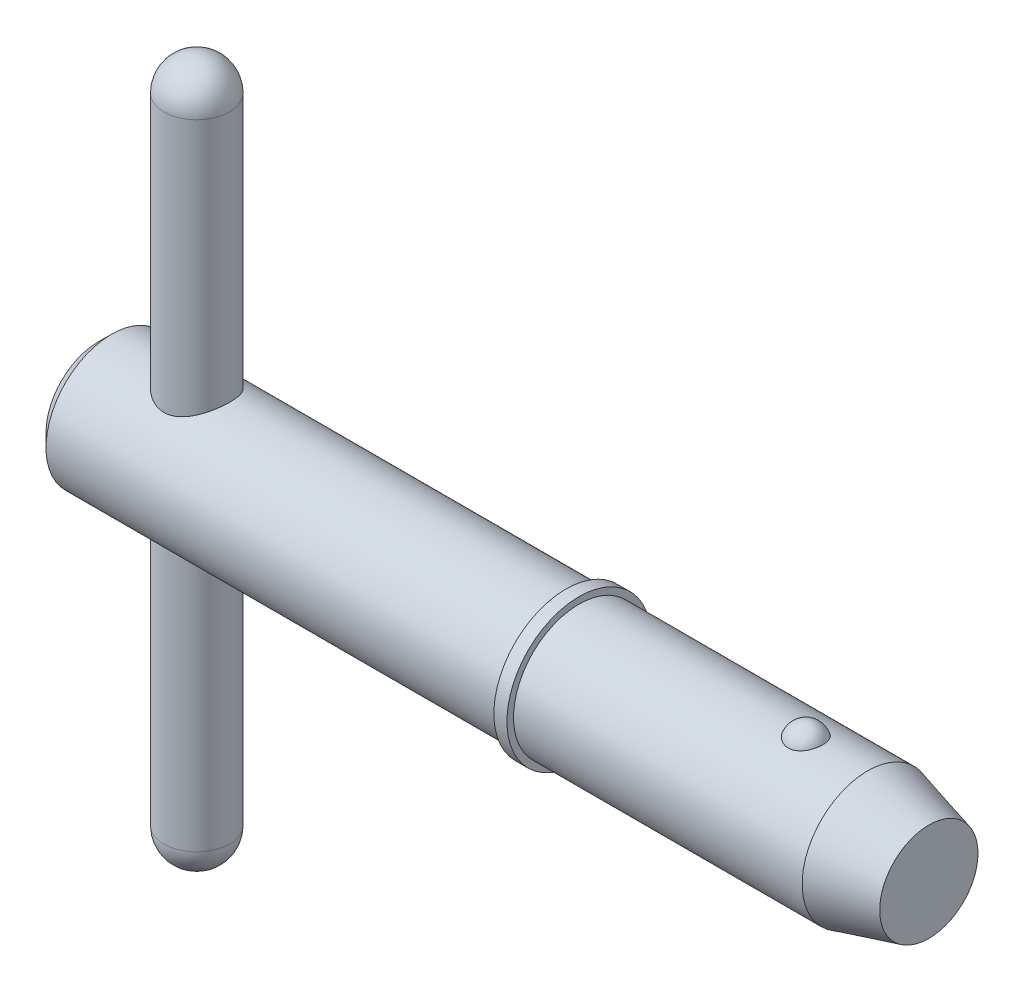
ISO-10303-21;
HEADER;
FILE_DESCRIPTION(('STEP AP214'),'2;1');
FILE_NAME('part.step','',(''),(''),'','','');
FILE_SCHEMA(('AUTOMOTIVE_DESIGN { 1 0 10303 214 1 1 1 1 }'));
ENDSEC;
DATA;
#1=APPLICATION_CONTEXT('core data for automotive mechanical design processes');
#2=APPLICATION_PROTOCOL_DEFINITION('international standard','automotive_design',2000,#1);
#3=PRODUCT_CONTEXT('',#1,'mechanical');
#4=PRODUCT('Part','Part','',(#3));
#5=PRODUCT_RELATED_PRODUCT_CATEGORY('part','',(#4));
#6=PRODUCT_DEFINITION_FORMATION('','',#4);
#7=PRODUCT_DEFINITION_CONTEXT('part definition',#1,'design');
#8=PRODUCT_DEFINITION('design','',#6,#7);
#9=PRODUCT_DEFINITION_SHAPE('','',#8);
#10=(LENGTH_UNIT() NAMED_UNIT(*) SI_UNIT(.MILLI.,.METRE.));
#11=(NAMED_UNIT(*) PLANE_ANGLE_UNIT() SI_UNIT($,.RADIAN.));
#12=(NAMED_UNIT(*) SI_UNIT($,.STERADIAN.) SOLID_ANGLE_UNIT());
#13=UNCERTAINTY_MEASURE_WITH_UNIT(LENGTH_MEASURE(1.E-05),#10,'distance_accuracy_value','');
#14=(GEOMETRIC_REPRESENTATION_CONTEXT(3) GLOBAL_UNCERTAINTY_ASSIGNED_CONTEXT((#13)) GLOBAL_UNIT_ASSIGNED_CONTEXT((#10,
#11,#12)) REPRESENTATION_CONTEXT('',''));
#15=CARTESIAN_POINT('',(0.,0.,0.));
#16=DIRECTION('',(0.,0.,1.));
#17=DIRECTION('',(1.,0.,0.));
#18=AXIS2_PLACEMENT_3D('',#15,#16,#17);
#19=CARTESIAN_POINT('',(3.57,12.7,0.));
#20=DIRECTION('',(0.,-1.,0.));
#21=DIRECTION('',(0.,0.,-1.));
#22=AXIS2_PLACEMENT_3D('',#19,#20,#21);
#23=CYLINDRICAL_SURFACE('',#22,1.19);
#24=CARTESIAN_POINT('',(3.57,-11.51,0.));
#25=DIRECTION('',(0.,-1.,0.));
#26=DIRECTION('',(0.,0.,-1.));
#27=AXIS2_PLACEMENT_3D('',#24,#25,#26);
#28=CIRCLE('',#27,1.19);
#29=CARTESIAN_POINT('',(3.57,-11.51,-1.19));
#30=VERTEX_POINT('',#29);
#31=EDGE_CURVE('P0_E10',#30,#30,#28,.F.);
#32=ORIENTED_EDGE('',*,*,#31,.T.);
#33=EDGE_LOOP('',(#32));
#34=FACE_BOUND('',#33,.T.);
#35=CARTESIAN_POINT('',(3.57,11.51,0.));
#36=DIRECTION('',(0.,-1.,0.));
#37=DIRECTION('',(0.,0.,-1.));
#38=AXIS2_PLACEMENT_3D('',#35,#36,#37);
#39=CIRCLE('',#38,1.19);
#40=CARTESIAN_POINT('',(3.57,11.51,-1.19));
#41=VERTEX_POINT('',#40);
#42=EDGE_CURVE('P0_E21',#41,#41,#39,.T.);
#43=ORIENTED_EDGE('',*,*,#42,.T.);
#44=EDGE_LOOP('',(#43));
#45=FACE_BOUND('',#44,.T.);
#46=ADVANCED_FACE('P0_F14',(#34,#45),#23,.T.);
#47=CARTESIAN_POINT('',(3.57,-11.51,0.));
#48=DIRECTION('',(0.,0.,1.));
#49=DIRECTION('',(1.,0.,0.));
#50=AXIS2_PLACEMENT_3D('',#47,#48,#49);
#51=SPHERICAL_SURFACE('',#50,1.19);
#52=CARTESIAN_POINT('',(3.57,-11.51,0.));
#53=DIRECTION('',(0.,-1.,0.));
#54=DIRECTION('',(0.,0.,-1.));
#55=AXIS2_PLACEMENT_3D('',#52,#53,#54);
#56=SPHERICAL_SURFACE('',#55,1.19);
#57=ORIENTED_EDGE('',*,*,#31,.F.);
#58=EDGE_LOOP('',(#57));
#59=FACE_BOUND('',#58,.T.);
#60=ADVANCED_FACE('P0_F29',(#59),#56,.T.);
#61=CARTESIAN_POINT('',(3.57,11.51,0.));
#62=DIRECTION('',(0.,0.,1.));
#63=DIRECTION('',(1.,0.,0.));
#64=AXIS2_PLACEMENT_3D('',#61,#62,#63);
#65=SPHERICAL_SURFACE('',#64,1.19);
#66=CARTESIAN_POINT('',(3.57,11.51,0.));
#67=DIRECTION('',(0.,-1.,0.));
#68=DIRECTION('',(0.,0.,-1.));
#69=AXIS2_PLACEMENT_3D('',#66,#67,#68);
#70=SPHERICAL_SURFACE('',#69,1.19);
#71=ORIENTED_EDGE('',*,*,#42,.F.);
#72=EDGE_LOOP('',(#71));
#73=FACE_BOUND('',#72,.T.);
#74=ADVANCED_FACE('P0_F16',(#73),#70,.T.);
#75=CLOSED_SHELL('',(#46,#60,#74));
#76=MANIFOLD_SOLID_BREP('P0_B1',#75);
#77=CARTESIAN_POINT('',(0.,0.,0.));
#78=DIRECTION('',(1.,0.,0.));
#79=DIRECTION('',(0.,0.,-1.));
#80=AXIS2_PLACEMENT_3D('',#77,#78,#79);
#81=CYLINDRICAL_SURFACE('',#80,2.38);
#82=CARTESIAN_POINT('',(27.9294297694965,0.,0.));
#83=DIRECTION('',(1.,0.,0.));
#84=DIRECTION('',(0.,0.,-1.));
#85=AXIS2_PLACEMENT_3D('',#82,#83,#84);
#86=CIRCLE('',#85,2.38);
#87=CARTESIAN_POINT('',(27.9294297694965,0.,-2.38));
#88=VERTEX_POINT('',#87);
#89=EDGE_CURVE('P1_E81',#88,#88,#86,.T.);
#90=ORIENTED_EDGE('',*,*,#89,.F.);
#91=EDGE_LOOP('',(#90));
#92=FACE_BOUND('',#91,.T.);
#93=CARTESIAN_POINT('',(17.45,0.,0.));
#94=DIRECTION('',(1.,0.,0.));
#95=DIRECTION('',(0.,0.,-1.));
#96=AXIS2_PLACEMENT_3D('',#93,#94,#95);
#97=CIRCLE('',#96,2.38);
#98=CARTESIAN_POINT('',(17.45,0.,-2.38));
#99=VERTEX_POINT('',#98);
#100=EDGE_CURVE('P1_E85',#99,#99,#97,.T.);
#101=ORIENTED_EDGE('',*,*,#100,.T.);
#102=EDGE_LOOP('',(#101));
#103=FACE_BOUND('',#102,.T.);
#104=CARTESIAN_POINT('',(25.6834492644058,2.2921568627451,0.640637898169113));
#105=CARTESIAN_POINT('',(25.6503559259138,2.29215737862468,0.64063719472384));
#106=CARTESIAN_POINT('',(25.6172546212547,2.29293179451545,0.637884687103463));
#107=CARTESIAN_POINT('',(25.5520176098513,2.29594030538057,0.626968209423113));
#108=CARTESIAN_POINT('',(25.5198823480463,2.29817506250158,0.618801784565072));
#109=CARTESIAN_POINT('',(25.4575402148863,2.3038430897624,0.597351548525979));
#110=CARTESIAN_POINT('',(25.4273305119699,2.30727454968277,0.584075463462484));
#111=CARTESIAN_POINT('',(25.3695674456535,2.31495941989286,0.552829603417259));
#112=CARTESIAN_POINT('',(25.3420141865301,2.31921286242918,0.53485964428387));
#113=CARTESIAN_POINT('',(25.2895938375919,2.32820213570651,0.494282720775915));
#114=CARTESIAN_POINT('',(25.2648050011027,2.33294694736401,0.471576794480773));
#115=CARTESIAN_POINT('',(25.2192169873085,2.34234144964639,0.422446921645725));
#116=CARTESIAN_POINT('',(25.1984185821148,2.34699112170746,0.396022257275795));
#117=CARTESIAN_POINT('',(25.1603580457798,2.35593942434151,0.338855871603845));
#118=CARTESIAN_POINT('',(25.1433051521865,2.36021170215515,0.307970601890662));
#119=CARTESIAN_POINT('',(25.1143607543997,2.3677057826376,0.243750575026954));
#120=CARTESIAN_POINT('',(25.1024701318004,2.37092740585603,0.210415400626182));
#121=CARTESIAN_POINT('',(25.0838076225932,2.37606901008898,0.141189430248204));
#122=CARTESIAN_POINT('',(25.0771956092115,2.37794816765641,0.105252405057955));
#123=CARTESIAN_POINT('',(25.0698095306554,2.38005135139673,0.0327351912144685));
#124=CARTESIAN_POINT('',(25.0690358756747,2.38027526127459,-0.00384504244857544));
#125=CARTESIAN_POINT('',(25.0733628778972,2.37903842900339,-0.0769838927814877));
#126=CARTESIAN_POINT('',(25.0785202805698,2.37756141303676,-0.113538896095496));
#127=CARTESIAN_POINT('',(25.0947013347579,2.37305303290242,-0.185229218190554));
#128=CARTESIAN_POINT('',(25.1057251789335,2.37002161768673,-0.220364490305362));
#129=CARTESIAN_POINT('',(25.1333977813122,2.36273722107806,-0.288156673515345));
#130=CARTESIAN_POINT('',(25.1500389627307,2.35848588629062,-0.320816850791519));
#131=CARTESIAN_POINT('',(25.1885984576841,2.34923130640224,-0.382744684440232));
#132=CARTESIAN_POINT('',(25.210516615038,2.34422808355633,-0.412012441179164));
#133=CARTESIAN_POINT('',(25.2587549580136,2.33412555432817,-0.465830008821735));
#134=CARTESIAN_POINT('',(25.2850028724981,2.32902887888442,-0.490444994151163));
#135=CARTESIAN_POINT('',(25.3414769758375,2.31926941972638,-0.534700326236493));
#136=CARTESIAN_POINT('',(25.371702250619,2.3146065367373,-0.554341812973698));
#137=CARTESIAN_POINT('',(25.4340618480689,2.30645675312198,-0.58731242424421));
#138=CARTESIAN_POINT('',(25.4660780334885,2.30293152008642,-0.60085527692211));
#139=CARTESIAN_POINT('',(25.5320795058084,2.29725171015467,-0.622220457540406));
#140=CARTESIAN_POINT('',(25.5660641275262,2.29509667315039,-0.630044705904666));
#141=CARTESIAN_POINT('',(25.633299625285,2.29249264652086,-0.639452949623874));
#142=CARTESIAN_POINT('',(25.6665087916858,2.29196755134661,-0.641315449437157));
#143=CARTESIAN_POINT('',(25.732763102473,2.29246849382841,-0.639522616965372));
#144=CARTESIAN_POINT('',(25.7658082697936,2.29349430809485,-0.635868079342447));
#145=CARTESIAN_POINT('',(25.8301025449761,2.29694059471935,-0.623301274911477));
#146=CARTESIAN_POINT('',(25.8613744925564,2.29933234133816,-0.614497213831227));
#147=CARTESIAN_POINT('',(25.9219952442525,2.30522511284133,-0.592006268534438));
#148=CARTESIAN_POINT('',(25.9513438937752,2.30872622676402,-0.57831899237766));
#149=CARTESIAN_POINT('',(26.0080369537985,2.31655795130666,-0.546112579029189));
#150=CARTESIAN_POINT('',(26.035320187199,2.32090569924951,-0.527490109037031));
#151=CARTESIAN_POINT('',(26.0864904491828,2.32992206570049,-0.486117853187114));
#152=CARTESIAN_POINT('',(26.1103767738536,2.33459075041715,-0.463367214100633));
#153=CARTESIAN_POINT('',(26.1552722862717,2.34399834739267,-0.413220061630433));
#154=CARTESIAN_POINT('',(26.1760972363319,2.34873051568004,-0.385657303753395));
#155=CARTESIAN_POINT('',(26.213056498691,2.35754932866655,-0.327455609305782));
#156=CARTESIAN_POINT('',(26.2291898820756,2.36163584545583,-0.2968160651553));
#157=CARTESIAN_POINT('',(26.2569822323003,2.36889321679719,-0.232047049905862));
#158=CARTESIAN_POINT('',(26.2684450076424,2.37202275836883,-0.197828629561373));
#159=CARTESIAN_POINT('',(26.2857523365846,2.37681926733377,-0.127900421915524));
#160=CARTESIAN_POINT('',(26.2915962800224,2.37848607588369,-0.092190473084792));
#161=CARTESIAN_POINT('',(26.297605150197,2.38020024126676,-0.0196348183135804));
#162=CARTESIAN_POINT('',(26.2976704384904,2.38021918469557,0.0172198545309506));
#163=CARTESIAN_POINT('',(26.2918689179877,2.37856356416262,0.0904219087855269));
#164=CARTESIAN_POINT('',(26.2860018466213,2.37688892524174,0.12676926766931));
#165=CARTESIAN_POINT('',(26.268425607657,2.37201688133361,0.198028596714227));
#166=CARTESIAN_POINT('',(26.2566998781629,2.36881516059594,0.232936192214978));
#167=CARTESIAN_POINT('',(26.2276354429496,2.36123444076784,0.300196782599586));
#168=CARTESIAN_POINT('',(26.2102967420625,2.3568554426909,0.33254977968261));
#169=CARTESIAN_POINT('',(26.1705350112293,2.34744667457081,0.393495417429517));
#170=CARTESIAN_POINT('',(26.1481528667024,2.34242227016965,0.422115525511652));
#171=CARTESIAN_POINT('',(26.0987391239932,2.33227293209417,0.475004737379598));
#172=CARTESIAN_POINT('',(26.0717076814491,2.32714800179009,0.499273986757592));
#173=CARTESIAN_POINT('',(26.0144988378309,2.31755359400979,0.542046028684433));
#174=CARTESIAN_POINT('',(25.9844297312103,2.3130698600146,0.560690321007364));
#175=CARTESIAN_POINT('',(25.9213869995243,2.30514125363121,0.592447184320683));
#176=CARTESIAN_POINT('',(25.8884158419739,2.30169550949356,0.605564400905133));
#177=CARTESIAN_POINT('',(25.8268424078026,2.29677744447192,0.623927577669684));
#178=CARTESIAN_POINT('',(25.7985555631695,2.295058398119,0.630178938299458));
#179=CARTESIAN_POINT('',(25.7413308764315,2.29274795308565,0.638534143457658));
#180=CARTESIAN_POINT('',(25.7123931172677,2.29215641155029,0.640638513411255));
#181=CARTESIAN_POINT('',(25.6834492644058,2.2921568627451,0.640637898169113));
#182=B_SPLINE_CURVE_WITH_KNOTS('',3,(#104,#105,#106,#107,#108,#109,#110,#111,#112,#113,#114,
#115,#116,#117,#118,#119,#120,#121,#122,#123,#124,#125,#126,#127,#128,#129,#130,#131,#132,#133,
#134,#135,#136,#137,#138,#139,#140,#141,#142,#143,#144,#145,#146,#147,#148,#149,#150,#151,#152,
#153,#154,#155,#156,#157,#158,#159,#160,#161,#162,#163,#164,#165,#166,#167,#168,#169,#170,#171,
#172,#173,#174,#175,#176,#177,#178,#179,#180,#181),.UNSPECIFIED.,.T.,.F.,(4,2,2,2,2,2,2,2,2,2,2,
2,2,2,2,2,2,2,2,2,2,2,2,2,2,2,2,2,2,2,2,2,2,2,2,2,2,2,4),(0.,0.0991724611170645,
0.19838992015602,0.297457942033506,0.396529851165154,0.49792776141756,0.59934527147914,
0.705475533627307,0.811623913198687,0.920876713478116,1.03013718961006,1.14045177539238,
1.25076998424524,1.36093998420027,1.47110672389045,1.57959248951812,1.68805336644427,
1.79234266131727,1.89659691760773,1.99590391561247,2.09519661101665,2.19247425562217,
2.28975970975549,2.38926978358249,2.48880044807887,2.59293588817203,2.69709193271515,
2.80525821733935,2.91343624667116,3.02347917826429,3.13352698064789,3.24388765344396,
3.35424823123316,3.46374443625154,3.5732369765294,3.67968690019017,3.78604717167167,
3.87279565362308,3.9595331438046),.UNSPECIFIED.);
#183=CARTESIAN_POINT('',(25.6834492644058,2.2921568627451,0.640637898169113));
#184=VERTEX_POINT('',#183);
#185=EDGE_CURVE('P1_E35',#184,#184,#182,.T.);
#186=ORIENTED_EDGE('',*,*,#185,.T.);
#187=EDGE_LOOP('',(#186));
#188=FACE_BOUND('',#187,.T.);
#189=ADVANCED_FACE('P1_F13',(#92,#103,#188),#81,.T.);
#190=CARTESIAN_POINT('',(0.,0.,0.));
#191=DIRECTION('',(-1.,0.,0.));
#192=DIRECTION('',(0.,0.,1.));
#193=AXIS2_PLACEMENT_3D('',#190,#191,#192);
#194=PLANE('',#193);
#195=CARTESIAN_POINT('',(0.,0.,0.));
#196=DIRECTION('',(1.,0.,0.));
#197=DIRECTION('',(0.,0.,-1.));
#198=AXIS2_PLACEMENT_3D('',#195,#196,#197);
#199=CIRCLE('',#198,1.904);
#200=CARTESIAN_POINT('',(0.,0.,-1.904));
#201=VERTEX_POINT('',#200);
#202=EDGE_CURVE('P1_E9',#201,#201,#199,.T.);
#203=ORIENTED_EDGE('',*,*,#202,.F.);
#204=EDGE_LOOP('',(#203));
#205=FACE_BOUND('',#204,.T.);
#206=ADVANCED_FACE('P1_F15',(#205),#194,.T.);
#207=CARTESIAN_POINT('',(0.475999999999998,0.,0.));
#208=DIRECTION('',(1.,0.,0.));
#209=DIRECTION('',(0.,0.,-1.));
#210=AXIS2_PLACEMENT_3D('',#207,#208,#209);
#211=CONICAL_SURFACE('',#210,2.38,0.78539816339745);
#212=ORIENTED_EDGE('',*,*,#202,.T.);
#213=EDGE_LOOP('',(#212));
#214=FACE_BOUND('',#213,.T.);
#215=CARTESIAN_POINT('',(0.475999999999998,0.,0.));
#216=DIRECTION('',(1.,0.,0.));
#217=DIRECTION('',(0.,0.,-1.));
#218=AXIS2_PLACEMENT_3D('',#215,#216,#217);
#219=CIRCLE('',#218,2.38);
#220=CARTESIAN_POINT('',(0.475999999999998,0.,-2.38));
#221=VERTEX_POINT('',#220);
#222=EDGE_CURVE('P1_E26',#221,#221,#219,.T.);
#223=ORIENTED_EDGE('',*,*,#222,.F.);
#224=EDGE_LOOP('',(#223));
#225=FACE_BOUND('',#224,.T.);
#226=ADVANCED_FACE('P1_F77',(#214,#225),#211,.T.);
#227=CARTESIAN_POINT('',(0.,0.,0.));
#228=DIRECTION('',(1.,0.,0.));
#229=DIRECTION('',(0.,0.,-1.));
#230=AXIS2_PLACEMENT_3D('',#227,#228,#229);
#231=CYLINDRICAL_SURFACE('',#230,2.38);
#232=CARTESIAN_POINT('',(3.57,-2.06114046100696,1.19));
#233=CARTESIAN_POINT('',(3.50799170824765,-2.06114586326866,1.18999567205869));
#234=CARTESIAN_POINT('',(3.4459051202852,-2.0639812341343,1.18512096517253));
#235=CARTESIAN_POINT('',(3.32363755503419,-2.07491216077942,1.16587061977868));
#236=CARTESIAN_POINT('',(3.26346086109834,-2.08301876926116,1.15147501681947));
#237=CARTESIAN_POINT('',(3.14701251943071,-2.10331722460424,1.11395893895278));
#238=CARTESIAN_POINT('',(3.09072196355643,-2.1154873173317,1.09088484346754));
#239=CARTESIAN_POINT('',(2.9828251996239,-2.14250771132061,1.03680835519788));
#240=CARTESIAN_POINT('',(2.93121924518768,-2.15735815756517,1.00580553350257));
#241=CARTESIAN_POINT('',(2.82945618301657,-2.18956274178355,0.933753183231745));
#242=CARTESIAN_POINT('',(2.77976962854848,-2.20702235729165,0.892085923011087));
#243=CARTESIAN_POINT('',(2.68772401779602,-2.2416265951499,0.801172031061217));
#244=CARTESIAN_POINT('',(2.64536861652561,-2.25877105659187,0.751921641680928));
#245=CARTESIAN_POINT('',(2.56639309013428,-2.29219557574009,0.64318258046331));
#246=CARTESIAN_POINT('',(2.53035201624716,-2.30833946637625,0.583227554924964));
#247=CARTESIAN_POINT('',(2.46908238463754,-2.3365739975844,0.45714686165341));
#248=CARTESIAN_POINT('',(2.44384700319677,-2.34866719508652,0.391025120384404));
#249=CARTESIAN_POINT('',(2.40676945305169,-2.36667748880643,0.259473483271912));
#250=CARTESIAN_POINT('',(2.39410206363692,-2.37297281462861,0.194329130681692));
#251=CARTESIAN_POINT('',(2.3798023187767,-2.3800902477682,0.0625590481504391));
#252=CARTESIAN_POINT('',(2.37816328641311,-2.38091566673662,-0.00406576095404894));
#253=CARTESIAN_POINT('',(2.38564854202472,-2.37717948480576,-0.130700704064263));
#254=CARTESIAN_POINT('',(2.39384923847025,-2.37308010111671,-0.190782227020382));
#255=CARTESIAN_POINT('',(2.41912820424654,-2.360653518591,-0.308583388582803));
#256=CARTESIAN_POINT('',(2.43620713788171,-2.35232600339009,-0.366302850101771));
#257=CARTESIAN_POINT('',(2.47886825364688,-2.33206184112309,-0.478748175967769));
#258=CARTESIAN_POINT('',(2.50456481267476,-2.32007685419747,-0.533421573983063));
#259=CARTESIAN_POINT('',(2.56357346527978,-2.29357798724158,-0.637812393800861));
#260=CARTESIAN_POINT('',(2.5968882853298,-2.27906320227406,-0.687528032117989));
#261=CARTESIAN_POINT('',(2.67380546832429,-2.24724829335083,-0.785606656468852));
#262=CARTESIAN_POINT('',(2.71808260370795,-2.22981457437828,-0.833397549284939));
#263=CARTESIAN_POINT('',(2.81386177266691,-2.19500665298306,-0.921184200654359));
#264=CARTESIAN_POINT('',(2.86536931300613,-2.17763250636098,-0.961173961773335));
#265=CARTESIAN_POINT('',(2.97815134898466,-2.14371545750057,-1.03471134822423));
#266=CARTESIAN_POINT('',(3.03983836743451,-2.12729540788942,-1.06768860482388));
#267=CARTESIAN_POINT('',(3.16889582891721,-2.09886785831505,-1.12254974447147));
#268=CARTESIAN_POINT('',(3.2362602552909,-2.0868557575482,-1.14444520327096));
#269=CARTESIAN_POINT('',(3.36914526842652,-2.06994116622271,-1.1747444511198));
#270=CARTESIAN_POINT('',(3.43438893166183,-2.06455070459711,-1.18407989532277));
#271=CARTESIAN_POINT('',(3.56571759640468,-2.06010324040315,-1.1918051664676));
#272=CARTESIAN_POINT('',(3.63180197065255,-2.06104176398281,-1.19020272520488));
#273=CARTESIAN_POINT('',(3.75522816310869,-2.06862860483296,-1.17695289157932));
#274=CARTESIAN_POINT('',(3.81273554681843,-2.07464109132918,-1.16642350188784));
#275=CARTESIAN_POINT('',(3.92505766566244,-2.09075885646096,-1.1372785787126));
#276=CARTESIAN_POINT('',(3.97987152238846,-2.1008654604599,-1.1186604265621));
#277=CARTESIAN_POINT('',(4.08813948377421,-2.12458104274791,-1.07296063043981));
#278=CARTESIAN_POINT('',(4.14141303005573,-2.13833055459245,-1.04552693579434));
#279=CARTESIAN_POINT('',(4.2429084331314,-2.16765782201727,-0.983281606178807));
#280=CARTESIAN_POINT('',(4.29112767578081,-2.18323651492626,-0.948466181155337));
#281=CARTESIAN_POINT('',(4.38750473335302,-2.2168271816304,-0.867316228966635));
#282=CARTESIAN_POINT('',(4.43488860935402,-2.23489833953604,-0.82008287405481));
#283=CARTESIAN_POINT('',(4.52130056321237,-2.26973739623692,-0.718051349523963));
#284=CARTESIAN_POINT('',(4.56032581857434,-2.28650485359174,-0.663250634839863));
#285=CARTESIAN_POINT('',(4.62978273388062,-2.31742220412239,-0.545657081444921));
#286=CARTESIAN_POINT('',(4.65996041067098,-2.33149133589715,-0.482691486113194));
#287=CARTESIAN_POINT('',(4.7089941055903,-2.35481192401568,-0.351671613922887));
#288=CARTESIAN_POINT('',(4.7278600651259,-2.36406760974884,-0.283621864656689));
#289=CARTESIAN_POINT('',(4.75210859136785,-2.3760433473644,-0.151105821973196));
#290=CARTESIAN_POINT('',(4.75856947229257,-2.37928514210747,-0.0868836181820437));
#291=CARTESIAN_POINT('',(4.76100348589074,-2.38050135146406,0.0417999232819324));
#292=CARTESIAN_POINT('',(4.75698028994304,-2.37847760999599,0.106261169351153));
#293=CARTESIAN_POINT('',(4.73927447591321,-2.36969422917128,0.229120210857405));
#294=CARTESIAN_POINT('',(4.72624582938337,-2.36325544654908,0.287637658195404));
#295=CARTESIAN_POINT('',(4.69178087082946,-2.34658591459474,0.401560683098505));
#296=CARTESIAN_POINT('',(4.67034335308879,-2.33635462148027,0.456965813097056));
#297=CARTESIAN_POINT('',(4.61871480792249,-2.31247857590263,0.565753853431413));
#298=CARTESIAN_POINT('',(4.58818860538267,-2.29870654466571,0.618948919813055));
#299=CARTESIAN_POINT('',(4.51967006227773,-2.26918878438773,0.719681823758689));
#300=CARTESIAN_POINT('',(4.48167429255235,-2.25344215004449,0.76721704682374));
#301=CARTESIAN_POINT('',(4.39491140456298,-2.21969046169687,0.860267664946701));
#302=CARTESIAN_POINT('',(4.34544863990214,-2.20161660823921,0.905111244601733));
#303=CARTESIAN_POINT('',(4.23943364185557,-2.16655060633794,0.986109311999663));
#304=CARTESIAN_POINT('',(4.18287520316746,-2.1495594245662,1.02225611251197));
#305=CARTESIAN_POINT('',(4.06190239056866,-2.1181953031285,1.08579298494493));
#306=CARTESIAN_POINT('',(3.9972962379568,-2.10392207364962,1.11287022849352));
#307=CARTESIAN_POINT('',(3.86353443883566,-2.08090726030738,1.15534566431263));
#308=CARTESIAN_POINT('',(3.7943948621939,-2.07214719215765,1.17078291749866));
#309=CARTESIAN_POINT('',(3.69875162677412,-2.06499834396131,1.18329673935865));
#310=CARTESIAN_POINT('',(3.67309220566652,-2.06355673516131,1.18580656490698));
#311=CARTESIAN_POINT('',(3.62162638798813,-2.06162663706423,1.18915915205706));
#312=CARTESIAN_POINT('',(3.59581998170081,-2.0611382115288,1.19000180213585));
#313=CARTESIAN_POINT('',(3.57,-2.06114046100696,1.19));
#314=B_SPLINE_CURVE_WITH_KNOTS('',3,(#232,#233,#234,#235,#236,#237,#238,#239,#240,#241,#242,
#243,#244,#245,#246,#247,#248,#249,#250,#251,#252,#253,#254,#255,#256,#257,#258,#259,#260,#261,
#262,#263,#264,#265,#266,#267,#268,#269,#270,#271,#272,#273,#274,#275,#276,#277,#278,#279,#280,
#281,#282,#283,#284,#285,#286,#287,#288,#289,#290,#291,#292,#293,#294,#295,#296,#297,#298,#299,
#300,#301,#302,#303,#304,#305,#306,#307,#308,#309,#310,#311,#312,#313),.UNSPECIFIED.,.T.,.F.,(4,
2,2,2,2,2,2,2,2,2,2,2,2,2,2,2,2,2,2,2,2,2,2,2,2,2,2,2,2,2,2,2,2,2,2,2,2,2,2,2,4),(0.,
0.185916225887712,0.372223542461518,0.557549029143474,0.742884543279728,0.943506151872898,
1.14422749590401,1.35847891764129,1.5725948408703,1.77147547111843,1.97023568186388,
2.15171156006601,2.33320101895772,2.51720146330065,2.70126786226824,2.902733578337,
3.10435357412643,3.31877721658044,3.53297641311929,3.73020126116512,3.92728670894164,
4.1028127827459,4.27839572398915,4.46211082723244,4.64592048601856,4.8529002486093,
5.0599497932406,5.27246375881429,5.48479067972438,5.67763601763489,5.87041383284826,
6.05048865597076,6.23058930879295,6.41839293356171,6.60628297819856,6.8128718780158,
7.01964271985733,7.2329479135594,7.44553408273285,7.52294360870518,7.60035831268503),.UNSPECIFIED.);
#315=CARTESIAN_POINT('',(3.57,-2.06114046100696,1.19));
#316=VERTEX_POINT('',#315);
#317=EDGE_CURVE('P1_E17',#316,#316,#314,.T.);
#318=ORIENTED_EDGE('',*,*,#317,.F.);
#319=EDGE_LOOP('',(#318));
#320=FACE_BOUND('',#319,.T.);
#321=CARTESIAN_POINT('',(3.57,2.06114046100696,1.19));
#322=CARTESIAN_POINT('',(3.63200829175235,2.06114586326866,1.18999567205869));
#323=CARTESIAN_POINT('',(3.6940948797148,2.0639812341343,1.18512096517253));
#324=CARTESIAN_POINT('',(3.81636244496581,2.07491216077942,1.16587061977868));
#325=CARTESIAN_POINT('',(3.87653913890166,2.08301876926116,1.15147501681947));
#326=CARTESIAN_POINT('',(3.99298748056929,2.10331722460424,1.11395893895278));
#327=CARTESIAN_POINT('',(4.04927803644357,2.1154873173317,1.09088484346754));
#328=CARTESIAN_POINT('',(4.1571748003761,2.14250771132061,1.03680835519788));
#329=CARTESIAN_POINT('',(4.20878075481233,2.15735815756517,1.00580553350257));
#330=CARTESIAN_POINT('',(4.31054381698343,2.18956274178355,0.933753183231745));
#331=CARTESIAN_POINT('',(4.36023037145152,2.20702235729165,0.892085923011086));
#332=CARTESIAN_POINT('',(4.45227598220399,2.2416265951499,0.801172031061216));
#333=CARTESIAN_POINT('',(4.49463138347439,2.25877105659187,0.751921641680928));
#334=CARTESIAN_POINT('',(4.57360690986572,2.29219557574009,0.643182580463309));
#335=CARTESIAN_POINT('',(4.60964798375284,2.30833946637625,0.583227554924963));
#336=CARTESIAN_POINT('',(4.67091761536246,2.3365739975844,0.457146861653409));
#337=CARTESIAN_POINT('',(4.69615299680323,2.34866719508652,0.391025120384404));
#338=CARTESIAN_POINT('',(4.73323054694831,2.36667748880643,0.259473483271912));
#339=CARTESIAN_POINT('',(4.74589793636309,2.37297281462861,0.194329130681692));
#340=CARTESIAN_POINT('',(4.7601976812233,2.3800902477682,0.0625590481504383));
#341=CARTESIAN_POINT('',(4.76183671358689,2.38091566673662,-0.00406576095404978));
#342=CARTESIAN_POINT('',(4.75435145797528,2.37717948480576,-0.130700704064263));
#343=CARTESIAN_POINT('',(4.74615076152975,2.37308010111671,-0.190782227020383));
#344=CARTESIAN_POINT('',(4.72087179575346,2.360653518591,-0.308583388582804));
#345=CARTESIAN_POINT('',(4.70379286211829,2.35232600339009,-0.366302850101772));
#346=CARTESIAN_POINT('',(4.66113174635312,2.33206184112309,-0.478748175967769));
#347=CARTESIAN_POINT('',(4.63543518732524,2.32007685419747,-0.533421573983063));
#348=CARTESIAN_POINT('',(4.57642653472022,2.29357798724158,-0.637812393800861));
#349=CARTESIAN_POINT('',(4.5431117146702,2.27906320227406,-0.687528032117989));
#350=CARTESIAN_POINT('',(4.46619453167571,2.24724829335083,-0.785606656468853));
#351=CARTESIAN_POINT('',(4.42191739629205,2.22981457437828,-0.83339754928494));
#352=CARTESIAN_POINT('',(4.32613822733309,2.19500665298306,-0.921184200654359));
#353=CARTESIAN_POINT('',(4.27463068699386,2.17763250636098,-0.961173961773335));
#354=CARTESIAN_POINT('',(4.16184865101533,2.14371545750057,-1.03471134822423));
#355=CARTESIAN_POINT('',(4.10016163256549,2.12729540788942,-1.06768860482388));
#356=CARTESIAN_POINT('',(3.97110417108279,2.09886785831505,-1.12254974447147));
#357=CARTESIAN_POINT('',(3.9037397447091,2.0868557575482,-1.14444520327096));
#358=CARTESIAN_POINT('',(3.77085473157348,2.06994116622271,-1.1747444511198));
#359=CARTESIAN_POINT('',(3.70561106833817,2.06455070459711,-1.18407989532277));
#360=CARTESIAN_POINT('',(3.57428240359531,2.06010324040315,-1.1918051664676));
#361=CARTESIAN_POINT('',(3.50819802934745,2.06104176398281,-1.19020272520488));
#362=CARTESIAN_POINT('',(3.38477183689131,2.06862860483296,-1.17695289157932));
#363=CARTESIAN_POINT('',(3.32726445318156,2.07464109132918,-1.16642350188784));
#364=CARTESIAN_POINT('',(3.21494233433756,2.09075885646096,-1.1372785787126));
#365=CARTESIAN_POINT('',(3.16012847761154,2.1008654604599,-1.1186604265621));
#366=CARTESIAN_POINT('',(3.05186051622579,2.12458104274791,-1.07296063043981));
#367=CARTESIAN_POINT('',(2.99858696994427,2.13833055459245,-1.04552693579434));
#368=CARTESIAN_POINT('',(2.8970915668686,2.16765782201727,-0.983281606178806));
#369=CARTESIAN_POINT('',(2.84887232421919,2.18323651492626,-0.948466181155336));
#370=CARTESIAN_POINT('',(2.75249526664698,2.2168271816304,-0.867316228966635));
#371=CARTESIAN_POINT('',(2.70511139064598,2.23489833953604,-0.820082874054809));
#372=CARTESIAN_POINT('',(2.61869943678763,2.26973739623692,-0.718051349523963));
#373=CARTESIAN_POINT('',(2.57967418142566,2.28650485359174,-0.663250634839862));
#374=CARTESIAN_POINT('',(2.51021726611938,2.31742220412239,-0.54565708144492));
#375=CARTESIAN_POINT('',(2.48003958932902,2.33149133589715,-0.482691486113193));
#376=CARTESIAN_POINT('',(2.4310058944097,2.35481192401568,-0.351671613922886));
#377=CARTESIAN_POINT('',(2.4121399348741,2.36406760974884,-0.283621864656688));
#378=CARTESIAN_POINT('',(2.38789140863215,2.3760433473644,-0.151105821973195));
#379=CARTESIAN_POINT('',(2.38143052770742,2.37928514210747,-0.0868836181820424));
#380=CARTESIAN_POINT('',(2.37899651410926,2.38050135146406,0.0417999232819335));
#381=CARTESIAN_POINT('',(2.38301971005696,2.37847760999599,0.106261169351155));
#382=CARTESIAN_POINT('',(2.40072552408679,2.36969422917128,0.229120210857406));
#383=CARTESIAN_POINT('',(2.41375417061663,2.36325544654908,0.287637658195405));
#384=CARTESIAN_POINT('',(2.44821912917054,2.34658591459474,0.401560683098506));
#385=CARTESIAN_POINT('',(2.46965664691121,2.33635462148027,0.456965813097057));
#386=CARTESIAN_POINT('',(2.52128519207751,2.31247857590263,0.565753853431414));
#387=CARTESIAN_POINT('',(2.55181139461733,2.29870654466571,0.618948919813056));
#388=CARTESIAN_POINT('',(2.62032993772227,2.26918878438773,0.719681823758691));
#389=CARTESIAN_POINT('',(2.65832570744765,2.25344215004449,0.767217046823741));
#390=CARTESIAN_POINT('',(2.74508859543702,2.21969046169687,0.860267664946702));
#391=CARTESIAN_POINT('',(2.79455136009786,2.20161660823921,0.905111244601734));
#392=CARTESIAN_POINT('',(2.90056635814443,2.16655060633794,0.986109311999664));
#393=CARTESIAN_POINT('',(2.95712479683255,2.1495594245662,1.02225611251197));
#394=CARTESIAN_POINT('',(3.07809760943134,2.1181953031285,1.08579298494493));
#395=CARTESIAN_POINT('',(3.1427037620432,2.10392207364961,1.11287022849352));
#396=CARTESIAN_POINT('',(3.27646556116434,2.08090726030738,1.15534566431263));
#397=CARTESIAN_POINT('',(3.3456051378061,2.07214719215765,1.17078291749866));
#398=CARTESIAN_POINT('',(3.44124837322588,2.06499834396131,1.18329673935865));
#399=CARTESIAN_POINT('',(3.46690779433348,2.06355673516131,1.18580656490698));
#400=CARTESIAN_POINT('',(3.51837361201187,2.06162663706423,1.18915915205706));
#401=CARTESIAN_POINT('',(3.54418001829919,2.0611382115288,1.19000180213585));
#402=CARTESIAN_POINT('',(3.57,2.06114046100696,1.19));
#403=B_SPLINE_CURVE_WITH_KNOTS('',3,(#321,#322,#323,#324,#325,#326,#327,#328,#329,#330,#331,
#332,#333,#334,#335,#336,#337,#338,#339,#340,#341,#342,#343,#344,#345,#346,#347,#348,#349,#350,
#351,#352,#353,#354,#355,#356,#357,#358,#359,#360,#361,#362,#363,#364,#365,#366,#367,#368,#369,
#370,#371,#372,#373,#374,#375,#376,#377,#378,#379,#380,#381,#382,#383,#384,#385,#386,#387,#388,
#389,#390,#391,#392,#393,#394,#395,#396,#397,#398,#399,#400,#401,#402),.UNSPECIFIED.,.T.,.F.,(4,
2,2,2,2,2,2,2,2,2,2,2,2,2,2,2,2,2,2,2,2,2,2,2,2,2,2,2,2,2,2,2,2,2,2,2,2,2,2,2,4),(0.,
0.185916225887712,0.372223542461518,0.557549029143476,0.74288454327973,0.9435061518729,
1.14422749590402,1.35847891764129,1.5725948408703,1.77147547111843,1.97023568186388,
2.15171156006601,2.33320101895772,2.51720146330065,2.70126786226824,2.902733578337,
3.10435357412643,3.31877721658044,3.53297641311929,3.73020126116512,3.92728670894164,
4.1028127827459,4.27839572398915,4.46211082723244,4.64592048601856,4.8529002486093,
5.05994979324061,5.27246375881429,5.48479067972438,5.67763601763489,5.87041383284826,
6.05048865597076,6.23058930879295,6.41839293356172,6.60628297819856,6.8128718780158,
7.01964271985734,7.2329479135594,7.44553408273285,7.52294360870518,7.60035831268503),.UNSPECIFIED.);
#404=CARTESIAN_POINT('',(3.57,2.06114046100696,1.19));
#405=VERTEX_POINT('',#404);
#406=EDGE_CURVE('P1_E43',#405,#405,#403,.T.);
#407=ORIENTED_EDGE('',*,*,#406,.F.);
#408=EDGE_LOOP('',(#407));
#409=FACE_BOUND('',#408,.T.);
#410=ORIENTED_EDGE('',*,*,#222,.T.);
#411=EDGE_LOOP('',(#410));
#412=FACE_BOUND('',#411,.T.);
#413=CARTESIAN_POINT('',(16.974,0.,0.));
#414=DIRECTION('',(1.,0.,0.));
#415=DIRECTION('',(0.,0.,-1.));
#416=AXIS2_PLACEMENT_3D('',#413,#414,#415);
#417=CIRCLE('',#416,2.38);
#418=CARTESIAN_POINT('',(16.974,0.,-2.38));
#419=VERTEX_POINT('',#418);
#420=EDGE_CURVE('P1_E31',#419,#419,#417,.T.);
#421=ORIENTED_EDGE('',*,*,#420,.F.);
#422=EDGE_LOOP('',(#421));
#423=FACE_BOUND('',#422,.T.);
#424=ADVANCED_FACE('P1_F103',(#320,#409,#412,#423),#231,.T.);
#425=CARTESIAN_POINT('',(16.974,2.38,0.));
#426=DIRECTION('',(-1.,0.,0.));
#427=DIRECTION('',(0.,0.,1.));
#428=AXIS2_PLACEMENT_3D('',#425,#426,#427);
#429=PLANE('',#428);
#430=ORIENTED_EDGE('',*,*,#420,.T.);
#431=EDGE_LOOP('',(#430));
#432=FACE_BOUND('',#431,.T.);
#433=CARTESIAN_POINT('',(16.974,0.,0.));
#434=DIRECTION('',(1.,0.,0.));
#435=DIRECTION('',(0.,0.,-1.));
#436=AXIS2_PLACEMENT_3D('',#433,#434,#435);
#437=CIRCLE('',#436,2.618);
#438=CARTESIAN_POINT('',(16.974,0.,-2.618));
#439=VERTEX_POINT('',#438);
#440=EDGE_CURVE('P1_E91',#439,#439,#437,.T.);
#441=ORIENTED_EDGE('',*,*,#440,.F.);
#442=EDGE_LOOP('',(#441));
#443=FACE_BOUND('',#442,.T.);
#444=ADVANCED_FACE('P1_F100',(#432,#443),#429,.T.);
#445=CARTESIAN_POINT('',(0.,0.,0.));
#446=DIRECTION('',(1.,0.,0.));
#447=DIRECTION('',(0.,0.,-1.));
#448=AXIS2_PLACEMENT_3D('',#445,#446,#447);
#449=CYLINDRICAL_SURFACE('',#448,2.618);
#450=ORIENTED_EDGE('',*,*,#440,.T.);
#451=EDGE_LOOP('',(#450));
#452=FACE_BOUND('',#451,.T.);
#453=CARTESIAN_POINT('',(17.45,0.,0.));
#454=DIRECTION('',(1.,0.,0.));
#455=DIRECTION('',(0.,0.,-1.));
#456=AXIS2_PLACEMENT_3D('',#453,#454,#455);
#457=CIRCLE('',#456,2.618);
#458=CARTESIAN_POINT('',(17.45,0.,-2.618));
#459=VERTEX_POINT('',#458);
#460=EDGE_CURVE('P1_E88',#459,#459,#457,.T.);
#461=ORIENTED_EDGE('',*,*,#460,.F.);
#462=EDGE_LOOP('',(#461));
#463=FACE_BOUND('',#462,.T.);
#464=ADVANCED_FACE('P1_F68',(#452,#463),#449,.T.);
#465=CARTESIAN_POINT('',(17.45,2.618,0.));
#466=DIRECTION('',(1.,0.,0.));
#467=DIRECTION('',(0.,0.,-1.));
#468=AXIS2_PLACEMENT_3D('',#465,#466,#467);
#469=PLANE('',#468);
#470=ORIENTED_EDGE('',*,*,#460,.T.);
#471=EDGE_LOOP('',(#470));
#472=FACE_BOUND('',#471,.T.);
#473=ORIENTED_EDGE('',*,*,#100,.F.);
#474=EDGE_LOOP('',(#473));
#475=FACE_BOUND('',#474,.T.);
#476=ADVANCED_FACE('P1_F62',(#472,#475),#469,.T.);
#477=CARTESIAN_POINT('',(30.15,0.,0.));
#478=DIRECTION('',(-1.,0.,0.));
#479=DIRECTION('',(0.,0.,1.));
#480=AXIS2_PLACEMENT_3D('',#477,#478,#479);
#481=CONICAL_SURFACE('',#480,1.785,0.261799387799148);
#482=ORIENTED_EDGE('',*,*,#89,.T.);
#483=EDGE_LOOP('',(#482));
#484=FACE_BOUND('',#483,.T.);
#485=CARTESIAN_POINT('',(30.15,0.,0.));
#486=DIRECTION('',(1.,0.,0.));
#487=DIRECTION('',(0.,0.,-1.));
#488=AXIS2_PLACEMENT_3D('',#485,#486,#487);
#489=CIRCLE('',#488,1.785);
#490=CARTESIAN_POINT('',(30.15,0.,-1.785));
#491=VERTEX_POINT('',#490);
#492=EDGE_CURVE('P1_E42',#491,#491,#489,.T.);
#493=ORIENTED_EDGE('',*,*,#492,.F.);
#494=EDGE_LOOP('',(#493));
#495=FACE_BOUND('',#494,.T.);
#496=ADVANCED_FACE('P1_F59',(#484,#495),#481,.T.);
#497=CARTESIAN_POINT('',(30.15,1.785,0.));
#498=DIRECTION('',(1.,0.,0.));
#499=DIRECTION('',(0.,0.,-1.));
#500=AXIS2_PLACEMENT_3D('',#497,#498,#499);
#501=PLANE('',#500);
#502=ORIENTED_EDGE('',*,*,#492,.T.);
#503=EDGE_LOOP('',(#502));
#504=FACE_BOUND('',#503,.T.);
#505=ADVANCED_FACE('P1_F55',(#504),#501,.T.);
#506=CARTESIAN_POINT('',(25.6834492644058,2.142,0.));
#507=DIRECTION('',(-1.,0.,0.));
#508=DIRECTION('',(0.,1.,0.));
#509=AXIS2_PLACEMENT_3D('',#506,#507,#508);
#510=SPHERICAL_SURFACE('',#509,0.657999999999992);
#511=ORIENTED_EDGE('',*,*,#185,.F.);
#512=EDGE_LOOP('',(#511));
#513=FACE_BOUND('',#512,.T.);
#514=ADVANCED_FACE('P1_F50',(#513),#510,.T.);
#515=CARTESIAN_POINT('',(3.57,-2.618,0.));
#516=DIRECTION('',(0.,1.,0.));
#517=DIRECTION('',(0.,0.,1.));
#518=AXIS2_PLACEMENT_3D('',#515,#516,#517);
#519=CYLINDRICAL_SURFACE('',#518,1.19);
#520=ORIENTED_EDGE('',*,*,#317,.T.);
#521=EDGE_LOOP('',(#520));
#522=FACE_BOUND('',#521,.T.);
#523=ORIENTED_EDGE('',*,*,#406,.T.);
#524=EDGE_LOOP('',(#523));
#525=FACE_BOUND('',#524,.T.);
#526=ADVANCED_FACE('P1_F54',(#522,#525),#519,.F.);
#527=CLOSED_SHELL('',(#189,#206,#226,#424,#444,#464,#476,#496,#505,#514,#526));
#528=MANIFOLD_SOLID_BREP('P1_B1',#527);
#529=ADVANCED_BREP_SHAPE_REPRESENTATION('',(#18,#76,#528),#14);
#530=SHAPE_DEFINITION_REPRESENTATION(#9,#529);
ENDSEC;
END-ISO-10303-21;
